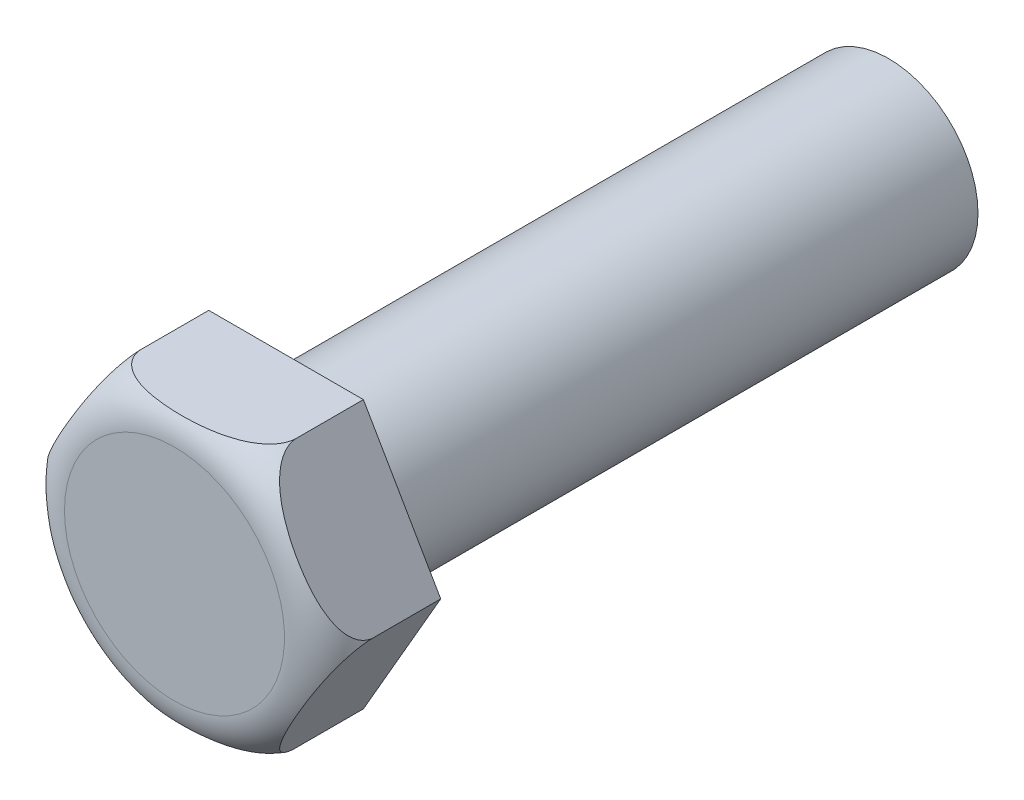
ISO-10303-21;
HEADER;
FILE_DESCRIPTION(('STEP AP214'),'2;1');
FILE_NAME('part.step','',(''),(''),'','','');
FILE_SCHEMA(('AUTOMOTIVE_DESIGN { 1 0 10303 214 1 1 1 1 }'));
ENDSEC;
DATA;
#1=APPLICATION_CONTEXT('core data for automotive mechanical design processes');
#2=APPLICATION_PROTOCOL_DEFINITION('international standard','automotive_design',2000,#1);
#3=PRODUCT_CONTEXT('',#1,'mechanical');
#4=PRODUCT('Part','Part','',(#3));
#5=PRODUCT_RELATED_PRODUCT_CATEGORY('part','',(#4));
#6=PRODUCT_DEFINITION_FORMATION('','',#4);
#7=PRODUCT_DEFINITION_CONTEXT('part definition',#1,'design');
#8=PRODUCT_DEFINITION('design','',#6,#7);
#9=PRODUCT_DEFINITION_SHAPE('','',#8);
#10=(LENGTH_UNIT() NAMED_UNIT(*) SI_UNIT(.MILLI.,.METRE.));
#11=(NAMED_UNIT(*) PLANE_ANGLE_UNIT() SI_UNIT($,.RADIAN.));
#12=(NAMED_UNIT(*) SI_UNIT($,.STERADIAN.) SOLID_ANGLE_UNIT());
#13=UNCERTAINTY_MEASURE_WITH_UNIT(LENGTH_MEASURE(1.E-05),#10,'distance_accuracy_value','');
#14=(GEOMETRIC_REPRESENTATION_CONTEXT(3) GLOBAL_UNCERTAINTY_ASSIGNED_CONTEXT((#13)) GLOBAL_UNIT_ASSIGNED_CONTEXT((#10,
#11,#12)) REPRESENTATION_CONTEXT('',''));
#15=CARTESIAN_POINT('',(0.,0.,0.));
#16=DIRECTION('',(0.,0.,1.));
#17=DIRECTION('',(1.,0.,0.));
#18=AXIS2_PLACEMENT_3D('',#15,#16,#17);
#19=CARTESIAN_POINT('',(35.,4.92661467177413E-13,-27.));
#20=DIRECTION('',(0.,0.,1.));
#21=DIRECTION('',(1.,0.,0.));
#22=AXIS2_PLACEMENT_3D('',#19,#20,#21);
#23=CYLINDRICAL_SURFACE('',#22,4.);
#24=CARTESIAN_POINT('',(35.,4.92661467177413E-13,-27.));
#25=DIRECTION('',(0.,0.,1.));
#26=DIRECTION('',(1.,0.,0.));
#27=AXIS2_PLACEMENT_3D('',#24,#25,#26);
#28=CIRCLE('',#27,4.);
#29=CARTESIAN_POINT('',(39.,4.92661467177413E-13,-27.));
#30=VERTEX_POINT('',#29);
#31=EDGE_CURVE('E11',#30,#30,#28,.T.);
#32=ORIENTED_EDGE('',*,*,#31,.T.);
#33=EDGE_LOOP('',(#32));
#34=FACE_BOUND('',#33,.T.);
#35=CARTESIAN_POINT('',(35.,4.92661467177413E-13,0.));
#36=DIRECTION('',(0.,0.,1.));
#37=DIRECTION('',(1.,0.,0.));
#38=AXIS2_PLACEMENT_3D('',#35,#36,#37);
#39=CIRCLE('',#38,4.);
#40=CARTESIAN_POINT('',(39.,4.92661467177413E-13,0.));
#41=VERTEX_POINT('',#40);
#42=EDGE_CURVE('E33',#41,#41,#39,.T.);
#43=ORIENTED_EDGE('',*,*,#42,.F.);
#44=EDGE_LOOP('',(#43));
#45=FACE_BOUND('',#44,.T.);
#46=ADVANCED_FACE('F26',(#34,#45),#23,.T.);
#47=CARTESIAN_POINT('',(35.,4.92661467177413E-13,-27.));
#48=DIRECTION('',(0.,0.,1.));
#49=DIRECTION('',(1.,0.,0.));
#50=AXIS2_PLACEMENT_3D('',#47,#48,#49);
#51=PLANE('',#50);
#52=ORIENTED_EDGE('',*,*,#31,.F.);
#53=EDGE_LOOP('',(#52));
#54=FACE_BOUND('',#53,.T.);
#55=ADVANCED_FACE('F115',(#54),#51,.F.);
#56=CARTESIAN_POINT('',(38.4641016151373,-5.99999999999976,5.));
#57=DIRECTION('',(-0.866025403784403,0.500000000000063,0.));
#58=DIRECTION('',(-0.500000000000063,-0.866025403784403,0.));
#59=AXIS2_PLACEMENT_3D('',#56,#57,#58);
#60=PLANE('',#59);
#61=DIRECTION('',(0.,0.,-1.));
#62=VECTOR('',#61,1.);
#63=CARTESIAN_POINT('',(41.9282032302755,0.,5.));
#64=LINE('',#63,#62);
#65=CARTESIAN_POINT('',(41.9282032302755,0.,2.99999999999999));
#66=VERTEX_POINT('',#65);
#67=CARTESIAN_POINT('',(41.9282032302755,0.,0.));
#68=VERTEX_POINT('',#67);
#69=EDGE_CURVE('E107',#66,#68,#64,.T.);
#70=ORIENTED_EDGE('',*,*,#69,.F.);
#71=CARTESIAN_POINT('',(41.9282032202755,-1.73205084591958E-08,2.99979999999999));
#72=CARTESIAN_POINT('',(41.9282085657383,9.24129264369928E-06,3.02934367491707));
#73=CARTESIAN_POINT('',(41.9275539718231,-0.00112454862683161,3.05887183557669));
#74=CARTESIAN_POINT('',(41.9249525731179,-0.00563030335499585,3.11768115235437));
#75=CARTESIAN_POINT('',(41.9230065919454,-0.00900084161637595,3.1469624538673));
#76=CARTESIAN_POINT('',(41.9153135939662,-0.0223255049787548,3.23369723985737));
#77=CARTESIAN_POINT('',(41.9077105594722,-0.0354943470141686,3.29052721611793));
#78=CARTESIAN_POINT('',(41.8880961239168,-0.0694675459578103,3.40083363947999));
#79=CARTESIAN_POINT('',(41.8760946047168,-0.0902547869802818,3.45431729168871));
#80=CARTESIAN_POINT('',(41.8483636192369,-0.138286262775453,3.55734093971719));
#81=CARTESIAN_POINT('',(41.8326270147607,-0.165542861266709,3.60687313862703));
#82=CARTESIAN_POINT('',(41.7888018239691,-0.24145031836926,3.72714474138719));
#83=CARTESIAN_POINT('',(41.7586370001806,-0.293697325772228,3.79485748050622));
#84=CARTESIAN_POINT('',(41.6933516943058,-0.406774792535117,3.91990090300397));
#85=CARTESIAN_POINT('',(41.6582195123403,-0.467625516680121,3.97720632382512));
#86=CARTESIAN_POINT('',(41.5621927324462,-0.633948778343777,4.1144349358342));
#87=CARTESIAN_POINT('',(41.4986434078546,-0.744019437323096,4.1868657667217));
#88=CARTESIAN_POINT('',(41.3670119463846,-0.972011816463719,4.31227447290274));
#89=CARTESIAN_POINT('',(41.2989206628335,-1.08994937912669,4.36521160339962));
#90=CARTESIAN_POINT('',(41.1597943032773,-1.33092330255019,4.45629465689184));
#91=CARTESIAN_POINT('',(41.0887406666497,-1.45399181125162,4.49432412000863));
#92=CARTESIAN_POINT('',(40.945266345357,-1.70249662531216,4.55844611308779));
#93=CARTESIAN_POINT('',(40.87284421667,-1.82793543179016,4.5845252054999));
#94=CARTESIAN_POINT('',(40.727003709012,-2.08053860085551,4.62725818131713));
#95=CARTESIAN_POINT('',(40.6535823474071,-2.20770812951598,4.64387005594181));
#96=CARTESIAN_POINT('',(40.5064449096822,-2.46255764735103,4.66913492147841));
#97=CARTESIAN_POINT('',(40.4327289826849,-2.59023737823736,4.67779152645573));
#98=CARTESIAN_POINT('',(40.2715323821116,-2.8694380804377,4.68901643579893));
#99=CARTESIAN_POINT('',(40.1840270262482,-3.02100180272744,4.6901629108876));
#100=CARTESIAN_POINT('',(40.0090620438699,-3.32405004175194,4.6827606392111));
#101=CARTESIAN_POINT('',(39.921602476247,-3.47553445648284,4.67420607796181));
#102=CARTESIAN_POINT('',(39.7475876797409,-3.77693692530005,4.64621390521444));
#103=CARTESIAN_POINT('',(39.6610301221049,-3.92685901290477,4.62683630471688));
#104=CARTESIAN_POINT('',(39.4889807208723,-4.22485731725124,4.57458020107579));
#105=CARTESIAN_POINT('',(39.4034876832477,-4.37293560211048,4.54171855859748));
#106=CARTESIAN_POINT('',(39.263133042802,-4.61603697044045,4.47222654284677));
#107=CARTESIAN_POINT('',(39.2076590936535,-4.71212066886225,4.44059934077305));
#108=CARTESIAN_POINT('',(39.098216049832,-4.90168158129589,4.36768698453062));
#109=CARTESIAN_POINT('',(39.0442485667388,-4.99515600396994,4.32639190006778));
#110=CARTESIAN_POINT('',(38.9384744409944,-5.17836216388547,4.23166332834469));
#111=CARTESIAN_POINT('',(38.8866884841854,-5.26805807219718,4.1781355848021));
#112=CARTESIAN_POINT('',(38.7875080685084,-5.43984359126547,4.05659769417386));
#113=CARTESIAN_POINT('',(38.7401050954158,-5.52194794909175,3.98861650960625));
#114=CARTESIAN_POINT('',(38.6683188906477,-5.64628530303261,3.86335065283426));
#115=CARTESIAN_POINT('',(38.6417880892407,-5.69223799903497,3.81101220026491));
#116=CARTESIAN_POINT('',(38.5928142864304,-5.77706311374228,3.69910751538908));
#117=CARTESIAN_POINT('',(38.5703674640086,-5.81594215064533,3.63954812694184));
#118=CARTESIAN_POINT('',(38.5338745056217,-5.87914980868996,3.52296156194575));
#119=CARTESIAN_POINT('',(38.5190743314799,-5.90478446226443,3.46688543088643));
#120=CARTESIAN_POINT('',(38.4943506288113,-5.94760717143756,3.35062109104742));
#121=CARTESIAN_POINT('',(38.4844167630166,-5.96481313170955,3.29044191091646));
#122=CARTESIAN_POINT('',(38.4729427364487,-5.98468672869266,3.19148118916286));
#123=CARTESIAN_POINT('',(38.4696403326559,-5.99040665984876,3.15349367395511));
#124=CARTESIAN_POINT('',(38.4652111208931,-5.9980782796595,3.07694805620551));
#125=CARTESIAN_POINT('',(38.4640882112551,-6.00002321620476,3.03838905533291));
#126=CARTESIAN_POINT('',(38.4641016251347,-5.99999998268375,2.99979999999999));
#127=B_SPLINE_CURVE_WITH_KNOTS('',3,(#71,#72,#73,#74,#75,#76,#77,#78,#79,#80,#81,#82,#83,#84,
#85,#86,#87,#88,#89,#90,#91,#92,#93,#94,#95,#96,#97,#98,#99,#100,#101,#102,#103,#104,#105,#106,
#107,#108,#109,#110,#111,#112,#113,#114,#115,#116,#117,#118,#119,#120,#121,#122,#123,#124,#125,
#126),.UNSPECIFIED.,.F.,.F.,(4,2,2,2,2,2,2,2,2,2,2,2,2,2,2,2,2,2,2,2,2,2,2,2,2,2,2,4),(0.,
0.0885718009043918,0.177087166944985,0.352681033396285,0.527882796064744,0.703422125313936,
0.973942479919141,1.24511096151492,1.68149626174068,2.11878856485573,2.55943201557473,
3.0005697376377,3.44364997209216,3.88652881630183,4.4113031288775,4.93639214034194,
5.45859816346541,5.98015319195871,6.32592314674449,6.67204982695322,7.02093924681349,
7.36913602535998,7.59210399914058,7.81486227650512,8.00434089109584,8.19341524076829,
8.30885546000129,8.4245019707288),.UNSPECIFIED.);
#128=CARTESIAN_POINT('',(38.4641016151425,-5.99999999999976,2.99999999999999));
#129=VERTEX_POINT('',#128);
#130=EDGE_CURVE('E134',#66,#129,#127,.T.);
#131=ORIENTED_EDGE('',*,*,#130,.T.);
#132=DIRECTION('',(0.,0.,-1.));
#133=VECTOR('',#132,1.);
#134=CARTESIAN_POINT('',(38.4641016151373,-5.99999999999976,5.));
#135=LINE('',#134,#133);
#136=CARTESIAN_POINT('',(38.4641016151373,-5.99999999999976,0.));
#137=VERTEX_POINT('',#136);
#138=EDGE_CURVE('E48',#129,#137,#135,.T.);
#139=ORIENTED_EDGE('',*,*,#138,.T.);
#140=DIRECTION('',(0.500000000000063,0.866025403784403,0.));
#141=VECTOR('',#140,1.);
#142=CARTESIAN_POINT('',(38.4641016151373,-5.99999999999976,0.));
#143=LINE('',#142,#141);
#144=EDGE_CURVE('E141',#137,#68,#143,.T.);
#145=ORIENTED_EDGE('',*,*,#144,.T.);
#146=EDGE_LOOP('',(#70,#131,#139,#145));
#147=FACE_BOUND('',#146,.T.);
#148=ADVANCED_FACE('F120',(#147),#60,.F.);
#149=CARTESIAN_POINT('',(41.9282032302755,0.,5.));
#150=DIRECTION('',(-0.866025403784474,-0.499999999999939,0.));
#151=DIRECTION('',(0.499999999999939,-0.866025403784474,0.));
#152=AXIS2_PLACEMENT_3D('',#149,#150,#151);
#153=PLANE('',#152);
#154=DIRECTION('',(0.,0.,-1.));
#155=VECTOR('',#154,1.);
#156=CARTESIAN_POINT('',(38.4641016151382,6.00000000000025,5.));
#157=LINE('',#156,#155);
#158=CARTESIAN_POINT('',(38.464101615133,6.00000000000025,2.99999999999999));
#159=VERTEX_POINT('',#158);
#160=CARTESIAN_POINT('',(38.4641016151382,6.00000000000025,0.));
#161=VERTEX_POINT('',#160);
#162=EDGE_CURVE('E101',#159,#161,#157,.T.);
#163=ORIENTED_EDGE('',*,*,#162,.F.);
#164=CARTESIAN_POINT('',(38.4641016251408,5.99999998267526,2.99979999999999));
#165=CARTESIAN_POINT('',(38.464096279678,6.00000924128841,3.02934367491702));
#166=CARTESIAN_POINT('',(38.4647508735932,5.99887545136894,3.0588718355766));
#167=CARTESIAN_POINT('',(38.4673522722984,5.99436969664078,3.11768115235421));
#168=CARTESIAN_POINT('',(38.4692982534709,5.99099915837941,3.1469624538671));
#169=CARTESIAN_POINT('',(38.47699125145,5.97767449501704,3.23369723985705));
#170=CARTESIAN_POINT('',(38.4845942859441,5.96450565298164,3.29052721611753));
#171=CARTESIAN_POINT('',(38.5042087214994,5.93053245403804,3.40083363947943));
#172=CARTESIAN_POINT('',(38.5162102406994,5.9097452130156,3.45431729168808));
#173=CARTESIAN_POINT('',(38.5439412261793,5.86171373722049,3.55734093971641));
#174=CARTESIAN_POINT('',(38.5596778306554,5.83445713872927,3.60687313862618));
#175=CARTESIAN_POINT('',(38.603503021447,5.7585496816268,3.7271447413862));
#176=CARTESIAN_POINT('',(38.6336678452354,5.70630267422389,3.79485748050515));
#177=CARTESIAN_POINT('',(38.6989531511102,5.59322520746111,3.91990090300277));
#178=CARTESIAN_POINT('',(38.7340853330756,5.53237448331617,3.97720632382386));
#179=CARTESIAN_POINT('',(38.8301121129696,5.36605122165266,4.11443493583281));
#180=CARTESIAN_POINT('',(38.8936614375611,5.25598056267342,4.18686576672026));
#181=CARTESIAN_POINT('',(39.025292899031,5.02798818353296,4.31227447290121));
#182=CARTESIAN_POINT('',(39.0933841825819,4.91005062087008,4.36521160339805));
#183=CARTESIAN_POINT('',(39.2325105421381,4.66907669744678,4.45629465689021));
#184=CARTESIAN_POINT('',(39.3035641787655,4.54600818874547,4.49432412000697));
#185=CARTESIAN_POINT('',(39.4470385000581,4.29750337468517,4.55844611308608));
#186=CARTESIAN_POINT('',(39.5194606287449,4.17206456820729,4.58452520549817));
#187=CARTESIAN_POINT('',(39.6653011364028,3.91946139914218,4.62725818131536));
#188=CARTESIAN_POINT('',(39.7387224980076,3.79229187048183,4.64387005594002));
#189=CARTESIAN_POINT('',(39.8858599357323,3.53744235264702,4.66913492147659));
#190=CARTESIAN_POINT('',(39.9595758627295,3.40976262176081,4.6777915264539));
#191=CARTESIAN_POINT('',(40.1207724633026,3.1305619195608,4.68901643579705));
#192=CARTESIAN_POINT('',(40.2082778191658,2.97899819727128,4.6901629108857));
#193=CARTESIAN_POINT('',(40.3832428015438,2.67594995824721,4.68276063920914));
#194=CARTESIAN_POINT('',(40.4707023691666,2.52446554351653,4.67420607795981));
#195=CARTESIAN_POINT('',(40.6447171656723,2.22306307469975,4.64621390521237));
#196=CARTESIAN_POINT('',(40.7312747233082,2.07314098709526,4.62683630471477));
#197=CARTESIAN_POINT('',(40.9033241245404,1.77514268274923,4.57458020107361));
#198=CARTESIAN_POINT('',(40.9888171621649,1.62706439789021,4.54171855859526));
#199=CARTESIAN_POINT('',(41.1291718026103,1.38396302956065,4.47222654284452));
#200=CARTESIAN_POINT('',(41.1846457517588,1.28787933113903,4.44059934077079));
#201=CARTESIAN_POINT('',(41.2940887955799,1.09831841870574,4.36768698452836));
#202=CARTESIAN_POINT('',(41.348056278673,1.00484399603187,4.32639190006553));
#203=CARTESIAN_POINT('',(41.4538304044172,0.821637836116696,4.23166332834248));
#204=CARTESIAN_POINT('',(41.5056163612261,0.731941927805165,4.17813558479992));
#205=CARTESIAN_POINT('',(41.6047967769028,0.56015640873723,4.05659769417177));
#206=CARTESIAN_POINT('',(41.6521997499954,0.478052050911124,3.98861650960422));
#207=CARTESIAN_POINT('',(41.7239859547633,0.353714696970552,3.86335065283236));
#208=CARTESIAN_POINT('',(41.7505167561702,0.307762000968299,3.81101220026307));
#209=CARTESIAN_POINT('',(41.7994905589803,0.222936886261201,3.69910751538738));
#210=CARTESIAN_POINT('',(41.8219373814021,0.184057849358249,3.63954812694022));
#211=CARTESIAN_POINT('',(41.8584303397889,0.120850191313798,3.52296156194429));
#212=CARTESIAN_POINT('',(41.8732305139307,0.0952155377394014,3.46688543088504));
#213=CARTESIAN_POINT('',(41.8979542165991,0.0523928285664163,3.35062109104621));
#214=CARTESIAN_POINT('',(41.9078880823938,0.0351868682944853,3.29044191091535));
#215=CARTESIAN_POINT('',(41.9193621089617,0.0153132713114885,3.19148118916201));
#216=CARTESIAN_POINT('',(41.9226645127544,0.00959334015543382,3.15349367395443));
#217=CARTESIAN_POINT('',(41.9270937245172,0.00192172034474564,3.07694805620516));
#218=CARTESIAN_POINT('',(41.9282166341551,-2.3216200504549E-05,3.03838905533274));
#219=CARTESIAN_POINT('',(41.9282032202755,1.73205091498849E-08,2.99979999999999));
#220=B_SPLINE_CURVE_WITH_KNOTS('',3,(#164,#165,#166,#167,#168,#169,#170,#171,#172,#173,#174,
#175,#176,#177,#178,#179,#180,#181,#182,#183,#184,#185,#186,#187,#188,#189,#190,#191,#192,#193,
#194,#195,#196,#197,#198,#199,#200,#201,#202,#203,#204,#205,#206,#207,#208,#209,#210,#211,#212,
#213,#214,#215,#216,#217,#218,#219),.UNSPECIFIED.,.F.,.F.,(4,2,2,2,2,2,2,2,2,2,2,2,2,2,2,2,2,2,
2,2,2,2,2,2,2,2,2,4),(0.,0.0885718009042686,0.177087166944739,0.352681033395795,
0.527882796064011,0.703422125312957,0.973942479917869,1.24511096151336,1.68149626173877,
2.11878856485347,2.55943201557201,3.00056973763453,3.44364997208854,3.88652881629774,
4.41130312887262,4.93639214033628,5.45859816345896,5.98015319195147,6.32592314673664,
6.67204982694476,7.02093924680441,7.36913602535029,7.59210399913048,7.81486227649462,
8.004340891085,8.19341524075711,8.3088554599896,8.42450197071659),.UNSPECIFIED.);
#221=EDGE_CURVE('E142',#159,#66,#220,.T.);
#222=ORIENTED_EDGE('',*,*,#221,.T.);
#223=ORIENTED_EDGE('',*,*,#69,.T.);
#224=DIRECTION('',(-0.499999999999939,0.866025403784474,0.));
#225=VECTOR('',#224,1.);
#226=CARTESIAN_POINT('',(41.9282032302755,0.,0.));
#227=LINE('',#226,#225);
#228=EDGE_CURVE('E200',#68,#161,#227,.T.);
#229=ORIENTED_EDGE('',*,*,#228,.T.);
#230=EDGE_LOOP('',(#163,#222,#223,#229));
#231=FACE_BOUND('',#230,.T.);
#232=ADVANCED_FACE('F127',(#231),#153,.F.);
#233=CARTESIAN_POINT('',(38.4641016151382,6.00000000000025,5.));
#234=DIRECTION('',(0.,-1.,0.));
#235=DIRECTION('',(1.,0.,0.));
#236=AXIS2_PLACEMENT_3D('',#233,#234,#235);
#237=PLANE('',#236);
#238=DIRECTION('',(0.,0.,-1.));
#239=VECTOR('',#238,1.);
#240=CARTESIAN_POINT('',(31.5358983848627,6.00000000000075,5.));
#241=LINE('',#240,#239);
#242=CARTESIAN_POINT('',(31.5358983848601,5.99999999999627,2.99999999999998));
#243=VERTEX_POINT('',#242);
#244=CARTESIAN_POINT('',(31.5358983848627,6.00000000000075,0.));
#245=VERTEX_POINT('',#244);
#246=EDGE_CURVE('E99',#243,#245,#241,.T.);
#247=ORIENTED_EDGE('',*,*,#246,.F.);
#248=CARTESIAN_POINT('',(35.0000000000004,6.00000000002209,4.68856497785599));
#249=CARTESIAN_POINT('',(35.1686041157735,6.00000000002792,4.688571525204));
#250=CARTESIAN_POINT('',(35.3372225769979,6.00000000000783,4.68410578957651));
#251=CARTESIAN_POINT('',(35.6740745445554,5.99999999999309,4.66564477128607));
#252=CARTESIAN_POINT('',(35.8423076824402,5.99999999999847,4.65164257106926));
#253=CARTESIAN_POINT('',(36.1774330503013,6.00000000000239,4.61223562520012));
#254=CARTESIAN_POINT('',(36.3443257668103,6.00000000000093,4.58683522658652));
#255=CARTESIAN_POINT('',(36.6750871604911,5.99999999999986,4.52146393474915));
#256=CARTESIAN_POINT('',(36.838959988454,6.00000000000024,4.48151489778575));
#257=CARTESIAN_POINT('',(37.1450411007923,6.00000000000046,4.38712344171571));
#258=CARTESIAN_POINT('',(37.2877842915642,6.00000000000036,4.33451519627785));
#259=CARTESIAN_POINT('',(37.4947218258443,6.00000000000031,4.24033987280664));
#260=CARTESIAN_POINT('',(37.562413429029,6.00000000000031,4.20646335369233));
#261=CARTESIAN_POINT('',(37.6945521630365,6.00000000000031,4.13292545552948));
#262=CARTESIAN_POINT('',(37.759001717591,6.0000000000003,4.0932684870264));
#263=CARTESIAN_POINT('',(37.8897716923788,6.00000000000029,4.00310383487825));
#264=CARTESIAN_POINT('',(37.9556229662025,6.00000000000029,3.95190460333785));
#265=CARTESIAN_POINT('',(38.0796090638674,6.00000000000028,3.84077297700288));
#266=CARTESIAN_POINT('',(38.13774828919,6.00000000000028,3.78084560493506));
#267=CARTESIAN_POINT('',(38.2338895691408,6.00000000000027,3.66319433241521));
#268=CARTESIAN_POINT('',(38.2736352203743,6.00000000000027,3.60690892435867));
#269=CARTESIAN_POINT('',(38.3433963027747,6.00000000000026,3.48858075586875));
#270=CARTESIAN_POINT('',(38.3734249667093,6.00000000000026,3.42654597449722));
#271=CARTESIAN_POINT('',(38.4177642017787,6.00000000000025,3.30792868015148));
#272=CARTESIAN_POINT('',(38.4337891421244,6.00000000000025,3.251990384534));
#273=CARTESIAN_POINT('',(38.456180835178,6.00000000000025,3.13820466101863));
#274=CARTESIAN_POINT('',(38.4625523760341,6.00000000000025,3.08035819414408));
#275=CARTESIAN_POINT('',(38.4651510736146,6.00000000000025,2.96435213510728));
#276=CARTESIAN_POINT('',(38.461363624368,6.00000000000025,2.90619221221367));
#277=CARTESIAN_POINT('',(38.4439126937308,6.00000000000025,2.79137983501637));
#278=CARTESIAN_POINT('',(38.4302461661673,6.00000000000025,2.73472785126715));
#279=CARTESIAN_POINT('',(38.3942281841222,6.00000000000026,2.62502382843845));
#280=CARTESIAN_POINT('',(38.3719787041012,6.00000000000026,2.57193780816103));
#281=CARTESIAN_POINT('',(38.3200958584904,6.00000000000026,2.46954366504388));
#282=CARTESIAN_POINT('',(38.2904596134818,6.00000000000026,2.42023702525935));
#283=CARTESIAN_POINT('',(38.207910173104,6.00000000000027,2.30092526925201));
#284=CARTESIAN_POINT('',(38.1509618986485,6.00000000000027,2.23370998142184));
#285=CARTESIAN_POINT('',(38.0271365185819,6.00000000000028,2.10915146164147));
#286=CARTESIAN_POINT('',(37.9602342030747,6.00000000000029,2.05183411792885));
#287=CARTESIAN_POINT('',(37.778394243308,6.0000000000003,1.91531676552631));
#288=CARTESIAN_POINT('',(37.6583128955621,6.00000000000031,1.84302226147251));
#289=CARTESIAN_POINT('',(37.4089565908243,6.00000000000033,1.71698911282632));
#290=CARTESIAN_POINT('',(37.2796632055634,6.00000000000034,1.66328899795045));
#291=CARTESIAN_POINT('',(37.0176171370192,6.00000000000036,1.57105246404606));
#292=CARTESIAN_POINT('',(36.8849232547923,6.00000000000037,1.53234463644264));
#293=CARTESIAN_POINT('',(36.6167047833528,6.00000000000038,1.46615535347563));
#294=CARTESIAN_POINT('',(36.4811773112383,6.00000000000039,1.43868598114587));
#295=CARTESIAN_POINT('',(36.2081299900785,6.00000000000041,1.39267161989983));
#296=CARTESIAN_POINT('',(36.0706045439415,6.00000000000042,1.37416078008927));
#297=CARTESIAN_POINT('',(35.7948380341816,6.00000000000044,1.34463146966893));
#298=CARTESIAN_POINT('',(35.6565972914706,6.00000000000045,1.3336098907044));
#299=CARTESIAN_POINT('',(35.3314518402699,6.00000000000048,1.31531229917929));
#300=CARTESIAN_POINT('',(35.1443968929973,6.00000000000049,1.31068488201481));
#301=CARTESIAN_POINT('',(34.7702206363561,6.00000000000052,1.31237798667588));
#302=CARTESIAN_POINT('',(34.5830993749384,6.00000000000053,1.31870632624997));
#303=CARTESIAN_POINT('',(34.2098449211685,6.00000000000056,1.34337069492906));
#304=CARTESIAN_POINT('',(34.0237106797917,6.00000000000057,1.36168903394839));
#305=CARTESIAN_POINT('',(33.7461744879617,6.00000000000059,1.40040651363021));
#306=CARTESIAN_POINT('',(33.6539806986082,6.0000000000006,1.41517657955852));
#307=CARTESIAN_POINT('',(33.4704012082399,6.00000000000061,1.44905313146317));
#308=CARTESIAN_POINT('',(33.3790153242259,6.00000000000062,1.46815860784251));
#309=CARTESIAN_POINT('',(33.1966956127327,6.00000000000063,1.51158690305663));
#310=CARTESIAN_POINT('',(33.1057713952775,6.00000000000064,1.53595060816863));
#311=CARTESIAN_POINT('',(32.9257722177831,6.00000000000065,1.59068534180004));
#312=CARTESIAN_POINT('',(32.8366963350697,6.00000000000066,1.62105328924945));
#313=CARTESIAN_POINT('',(32.6617030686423,6.00000000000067,1.68869663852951));
#314=CARTESIAN_POINT('',(32.5757716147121,6.00000000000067,1.72593512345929));
#315=CARTESIAN_POINT('',(32.4079982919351,6.00000000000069,1.80860760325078));
#316=CARTESIAN_POINT('',(32.3261514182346,6.00000000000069,1.85403123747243));
#317=CARTESIAN_POINT('',(32.1791585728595,6.0000000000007,1.94762265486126));
#318=CARTESIAN_POINT('',(32.1132527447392,6.00000000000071,1.99458355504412));
#319=CARTESIAN_POINT('',(31.9877465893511,6.00000000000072,2.09654168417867));
#320=CARTESIAN_POINT('',(31.9281529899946,6.00000000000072,2.15154734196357));
#321=CARTESIAN_POINT('',(31.8173401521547,6.00000000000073,2.27080506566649));
#322=CARTESIAN_POINT('',(31.7662283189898,6.00000000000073,2.33515881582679));
#323=CARTESIAN_POINT('',(31.6769491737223,6.00000000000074,2.47229349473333));
#324=CARTESIAN_POINT('',(31.6387468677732,6.00000000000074,2.54505091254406));
#325=CARTESIAN_POINT('',(31.5876963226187,6.00000000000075,2.67520114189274));
#326=CARTESIAN_POINT('',(31.5707138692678,6.00000000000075,2.73097704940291));
#327=CARTESIAN_POINT('',(31.5463555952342,6.00000000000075,2.84459813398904));
#328=CARTESIAN_POINT('',(31.5389737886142,6.00000000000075,2.90244199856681));
#329=CARTESIAN_POINT('',(31.5343801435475,6.00000000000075,3.01864328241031));
#330=CARTESIAN_POINT('',(31.5371871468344,6.00000000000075,3.07700145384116));
#331=CARTESIAN_POINT('',(31.5527873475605,6.00000000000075,3.19236236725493));
#332=CARTESIAN_POINT('',(31.5655833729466,6.00000000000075,3.24936472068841));
#333=CARTESIAN_POINT('',(31.5999274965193,6.00000000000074,3.35954912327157));
#334=CARTESIAN_POINT('',(31.6213213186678,6.00000000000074,3.41278000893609));
#335=CARTESIAN_POINT('',(31.6715771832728,6.00000000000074,3.51555710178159));
#336=CARTESIAN_POINT('',(31.7004424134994,6.00000000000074,3.56510172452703));
#337=CARTESIAN_POINT('',(31.7805968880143,6.00000000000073,3.68424362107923));
#338=CARTESIAN_POINT('',(31.8358181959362,6.00000000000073,3.75119711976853));
#339=CARTESIAN_POINT('',(31.9561791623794,6.00000000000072,3.87547509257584));
#340=CARTESIAN_POINT('',(32.021341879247,6.00000000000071,3.93277651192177));
#341=CARTESIAN_POINT('',(32.1979345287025,6.0000000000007,4.0688589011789));
#342=CARTESIAN_POINT('',(32.3144161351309,6.00000000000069,4.14103363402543));
#343=CARTESIAN_POINT('',(32.5567176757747,6.00000000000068,4.2673440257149));
#344=CARTESIAN_POINT('',(32.6825625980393,6.00000000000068,4.32142913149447));
#345=CARTESIAN_POINT('',(32.9366979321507,6.00000000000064,4.41426863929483));
#346=CARTESIAN_POINT('',(33.0648832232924,6.0000000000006,4.45331819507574));
#347=CARTESIAN_POINT('',(33.3241401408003,6.00000000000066,4.52052337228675));
#348=CARTESIAN_POINT('',(33.455214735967,6.00000000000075,4.54866717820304));
#349=CARTESIAN_POINT('',(33.7189688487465,6.00000000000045,4.59618443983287));
#350=CARTESIAN_POINT('',(33.8516491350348,6.00000000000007,4.6155535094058));
#351=CARTESIAN_POINT('',(34.1177796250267,6.00000000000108,4.6470470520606));
#352=CARTESIAN_POINT('',(34.2512294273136,6.00000000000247,4.65917500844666));
#353=CARTESIAN_POINT('',(34.4872470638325,5.99999999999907,4.67509046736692));
#354=CARTESIAN_POINT('',(34.5897319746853,5.99999999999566,4.68016573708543));
#355=CARTESIAN_POINT('',(34.7948094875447,6.00000000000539,4.6869009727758));
#356=CARTESIAN_POINT('',(34.8974020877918,6.00000000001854,4.68856099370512));
#357=CARTESIAN_POINT('',(35.0000000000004,6.00000000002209,4.68856497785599));
#358=B_SPLINE_CURVE_WITH_KNOTS('',3,(#248,#249,#250,#251,#252,#253,#254,#255,#256,#257,#258,
#259,#260,#261,#262,#263,#264,#265,#266,#267,#268,#269,#270,#271,#272,#273,#274,#275,#276,#277,
#278,#279,#280,#281,#282,#283,#284,#285,#286,#287,#288,#289,#290,#291,#292,#293,#294,#295,#296,
#297,#298,#299,#300,#301,#302,#303,#304,#305,#306,#307,#308,#309,#310,#311,#312,#313,#314,#315,
#316,#317,#318,#319,#320,#321,#322,#323,#324,#325,#326,#327,#328,#329,#330,#331,#332,#333,#334,
#335,#336,#337,#338,#339,#340,#341,#342,#343,#344,#345,#346,#347,#348,#349,#350,#351,#352,#353,
#354,#355,#356,#357),.UNSPECIFIED.,.T.,.F.,(4,2,2,2,2,2,2,2,2,2,2,2,2,2,2,2,2,2,2,2,2,2,2,2,2,2,
2,2,2,2,2,2,2,2,2,2,2,2,2,2,2,2,2,2,2,2,2,2,2,2,2,2,2,2,4),(0.,0.505772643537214,
1.01191255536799,1.51785959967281,2.02304967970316,2.47805042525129,2.70490524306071,
2.93158786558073,3.18117872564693,3.430626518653,3.63656974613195,3.84223132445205,
4.01603128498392,4.18974501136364,4.36370862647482,4.53772590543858,4.70973637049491,
4.88181399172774,5.14459875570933,5.40806075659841,5.82617987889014,6.24516027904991,
6.65919809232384,7.07367989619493,7.48972945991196,7.90560624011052,8.46658596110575,
9.02796614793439,9.588519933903,9.86854716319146,10.1485092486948,10.4307321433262,
10.7128105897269,10.9934153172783,11.2736673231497,11.5159254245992,11.7584391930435,
12.0038218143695,12.2485338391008,12.4227032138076,12.5967639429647,12.7711467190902,
12.9455788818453,13.1170116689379,13.2885177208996,13.5474021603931,13.8068964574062,
14.2156682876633,14.6255731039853,15.0269620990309,15.4287847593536,15.8308080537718,
16.2326378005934,16.5404123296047,16.8481819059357),.UNSPECIFIED.);
#359=EDGE_CURVE('E81',#243,#159,#358,.T.);
#360=ORIENTED_EDGE('',*,*,#359,.T.);
#361=ORIENTED_EDGE('',*,*,#162,.T.);
#362=DIRECTION('',(-1.,0.,0.));
#363=VECTOR('',#362,1.);
#364=CARTESIAN_POINT('',(38.4641016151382,6.00000000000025,0.));
#365=LINE('',#364,#363);
#366=EDGE_CURVE('E204',#161,#245,#365,.T.);
#367=ORIENTED_EDGE('',*,*,#366,.T.);
#368=EDGE_LOOP('',(#247,#360,#361,#367));
#369=FACE_BOUND('',#368,.T.);
#370=ADVANCED_FACE('F174',(#369),#237,.F.);
#371=CARTESIAN_POINT('',(31.5358983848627,6.00000000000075,5.));
#372=DIRECTION('',(0.866025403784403,-0.500000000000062,0.));
#373=DIRECTION('',(0.500000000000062,0.866025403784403,0.));
#374=AXIS2_PLACEMENT_3D('',#371,#372,#373);
#375=PLANE('',#374);
#376=DIRECTION('',(0.,0.,-1.));
#377=VECTOR('',#376,1.);
#378=CARTESIAN_POINT('',(28.0717967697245,9.89685536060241E-13,5.));
#379=LINE('',#378,#377);
#380=CARTESIAN_POINT('',(28.0717967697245,1.01177746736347E-12,2.99999999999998));
#381=VERTEX_POINT('',#380);
#382=CARTESIAN_POINT('',(28.0717967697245,9.89685536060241E-13,0.));
#383=VERTEX_POINT('',#382);
#384=EDGE_CURVE('E90',#381,#383,#379,.T.);
#385=ORIENTED_EDGE('',*,*,#384,.F.);
#386=CARTESIAN_POINT('',(28.0717967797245,1.73214747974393E-08,2.99979999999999));
#387=CARTESIAN_POINT('',(28.0717914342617,-9.24129167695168E-06,3.02934367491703));
#388=CARTESIAN_POINT('',(28.0724460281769,0.00112454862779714,3.0588718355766));
#389=CARTESIAN_POINT('',(28.0750474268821,0.00563030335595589,3.11768115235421));
#390=CARTESIAN_POINT('',(28.0769934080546,0.00900084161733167,3.1469624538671));
#391=CARTESIAN_POINT('',(28.0846864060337,0.0223255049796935,3.23369723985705));
#392=CARTESIAN_POINT('',(28.0922894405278,0.0354943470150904,3.29052721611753));
#393=CARTESIAN_POINT('',(28.1119038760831,0.0694675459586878,3.40083363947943));
#394=CARTESIAN_POINT('',(28.1239053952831,0.090254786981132,3.45431729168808));
#395=CARTESIAN_POINT('',(28.151636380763,0.138286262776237,3.55734093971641));
#396=CARTESIAN_POINT('',(28.1673729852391,0.165542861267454,3.60687313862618));
#397=CARTESIAN_POINT('',(28.2111981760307,0.241450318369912,3.72714474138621));
#398=CARTESIAN_POINT('',(28.2413629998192,0.293697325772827,3.79485748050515));
#399=CARTESIAN_POINT('',(28.3066483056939,0.406774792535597,3.91990090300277));
#400=CARTESIAN_POINT('',(28.3417804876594,0.467625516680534,3.97720632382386));
#401=CARTESIAN_POINT('',(28.4378072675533,0.633948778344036,4.11443493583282));
#402=CARTESIAN_POINT('',(28.5013565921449,0.744019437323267,4.18686576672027));
#403=CARTESIAN_POINT('',(28.6329880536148,0.972011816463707,4.31227447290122));
#404=CARTESIAN_POINT('',(28.7010793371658,1.08994937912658,4.36521160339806));
#405=CARTESIAN_POINT('',(28.840205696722,1.33092330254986,4.45629465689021));
#406=CARTESIAN_POINT('',(28.9112593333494,1.45399181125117,4.49432412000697));
#407=CARTESIAN_POINT('',(29.0547336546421,1.70249662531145,4.55844611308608));
#408=CARTESIAN_POINT('',(29.1271557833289,1.82793543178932,4.58452520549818));
#409=CARTESIAN_POINT('',(29.2729962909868,2.08053860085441,4.62725818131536));
#410=CARTESIAN_POINT('',(29.3464176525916,2.20770812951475,4.64387005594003));
#411=CARTESIAN_POINT('',(29.4935550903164,2.46255764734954,4.6691349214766));
#412=CARTESIAN_POINT('',(29.5672710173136,2.59023737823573,4.6777915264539));
#413=CARTESIAN_POINT('',(29.7284676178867,2.86943808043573,4.68901643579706));
#414=CARTESIAN_POINT('',(29.81597297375,3.02100180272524,4.6901629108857));
#415=CARTESIAN_POINT('',(29.990937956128,3.32405004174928,4.68276063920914));
#416=CARTESIAN_POINT('',(30.0783975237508,3.47553445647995,4.67420607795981));
#417=CARTESIAN_POINT('',(30.2524123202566,3.77693692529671,4.64621390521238));
#418=CARTESIAN_POINT('',(30.3389698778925,3.9268590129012,4.62683630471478));
#419=CARTESIAN_POINT('',(30.5110192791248,4.2248573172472,4.57458020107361));
#420=CARTESIAN_POINT('',(30.5965123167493,4.37293560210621,4.54171855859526));
#421=CARTESIAN_POINT('',(30.7368669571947,4.61603697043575,4.47222654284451));
#422=CARTESIAN_POINT('',(30.7923409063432,4.71212066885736,4.44059934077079));
#423=CARTESIAN_POINT('',(30.9017839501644,4.90168158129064,4.36768698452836));
#424=CARTESIAN_POINT('',(30.9557514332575,4.9951560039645,4.32639190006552));
#425=CARTESIAN_POINT('',(31.0615255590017,5.17836216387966,4.23166332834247));
#426=CARTESIAN_POINT('',(31.1133115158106,5.26805807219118,4.17813558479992));
#427=CARTESIAN_POINT('',(31.2124919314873,5.4398435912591,4.05659769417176));
#428=CARTESIAN_POINT('',(31.2598949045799,5.5219479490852,3.98861650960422));
#429=CARTESIAN_POINT('',(31.3316811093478,5.64628530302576,3.86335065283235));
#430=CARTESIAN_POINT('',(31.3582119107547,5.69223799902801,3.81101220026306));
#431=CARTESIAN_POINT('',(31.4071857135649,5.7770631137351,3.69910751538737));
#432=CARTESIAN_POINT('',(31.4296325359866,5.81594215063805,3.63954812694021));
#433=CARTESIAN_POINT('',(31.4661254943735,5.87914980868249,3.52296156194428));
#434=CARTESIAN_POINT('',(31.4809256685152,5.90478446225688,3.46688543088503));
#435=CARTESIAN_POINT('',(31.5056493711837,5.94760717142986,3.3506210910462));
#436=CARTESIAN_POINT('',(31.5155832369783,5.96481313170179,3.29044191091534));
#437=CARTESIAN_POINT('',(31.5270572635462,5.98468672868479,3.191481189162));
#438=CARTESIAN_POINT('',(31.5303596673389,5.99040665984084,3.15349367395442));
#439=CARTESIAN_POINT('',(31.5347888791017,5.99807827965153,3.07694805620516));
#440=CARTESIAN_POINT('',(31.5359117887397,6.00002321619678,3.03838905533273));
#441=CARTESIAN_POINT('',(31.5358983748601,5.99999998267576,2.99979999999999));
#442=B_SPLINE_CURVE_WITH_KNOTS('',3,(#386,#387,#388,#389,#390,#391,#392,#393,#394,#395,#396,
#397,#398,#399,#400,#401,#402,#403,#404,#405,#406,#407,#408,#409,#410,#411,#412,#413,#414,#415,
#416,#417,#418,#419,#420,#421,#422,#423,#424,#425,#426,#427,#428,#429,#430,#431,#432,#433,#434,
#435,#436,#437,#438,#439,#440,#441),.UNSPECIFIED.,.F.,.F.,(4,2,2,2,2,2,2,2,2,2,2,2,2,2,2,2,2,2,
2,2,2,2,2,2,2,2,2,4),(0.,0.0885718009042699,0.17708716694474,0.352681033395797,
0.527882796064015,0.703422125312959,0.973942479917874,1.24511096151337,1.68149626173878,
2.11878856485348,2.55943201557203,3.00056973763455,3.44364997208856,3.88652881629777,
4.41130312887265,4.93639214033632,5.45859816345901,5.98015319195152,6.3259231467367,
6.67204982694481,7.02093924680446,7.36913602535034,7.59210399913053,7.81486227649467,
8.00434089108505,8.19341524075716,8.30885545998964,8.42450197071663),.UNSPECIFIED.);
#443=EDGE_CURVE('E78',#381,#243,#442,.T.);
#444=ORIENTED_EDGE('',*,*,#443,.T.);
#445=ORIENTED_EDGE('',*,*,#246,.T.);
#446=DIRECTION('',(-0.500000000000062,-0.866025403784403,0.));
#447=VECTOR('',#446,1.);
#448=CARTESIAN_POINT('',(31.5358983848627,6.00000000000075,0.));
#449=LINE('',#448,#447);
#450=EDGE_CURVE('E97',#245,#383,#449,.T.);
#451=ORIENTED_EDGE('',*,*,#450,.T.);
#452=EDGE_LOOP('',(#385,#444,#445,#451));
#453=FACE_BOUND('',#452,.T.);
#454=ADVANCED_FACE('F95',(#453),#375,.F.);
#455=CARTESIAN_POINT('',(28.0717967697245,9.89685536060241E-13,5.));
#456=DIRECTION('',(0.866025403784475,0.499999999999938,0.));
#457=DIRECTION('',(-0.499999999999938,0.866025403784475,0.));
#458=AXIS2_PLACEMENT_3D('',#455,#456,#457);
#459=PLANE('',#458);
#460=DIRECTION('',(0.,0.,-1.));
#461=VECTOR('',#460,1.);
#462=CARTESIAN_POINT('',(31.5358983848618,-5.99999999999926,5.));
#463=LINE('',#462,#461);
#464=CARTESIAN_POINT('',(31.5358983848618,-5.99999999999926,2.99999999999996));
#465=VERTEX_POINT('',#464);
#466=CARTESIAN_POINT('',(31.5358983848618,-5.99999999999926,0.));
#467=VERTEX_POINT('',#466);
#468=EDGE_CURVE('E92',#465,#467,#463,.T.);
#469=ORIENTED_EDGE('',*,*,#468,.F.);
#470=CARTESIAN_POINT('',(31.5358983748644,-5.99999998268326,2.99979999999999));
#471=CARTESIAN_POINT('',(31.5359037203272,-6.00000924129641,3.02934367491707));
#472=CARTESIAN_POINT('',(31.535249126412,-5.99887545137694,3.05887183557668));
#473=CARTESIAN_POINT('',(31.5326477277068,-5.99436969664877,3.11768115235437));
#474=CARTESIAN_POINT('',(31.5307017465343,-5.99099915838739,3.1469624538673));
#475=CARTESIAN_POINT('',(31.5230087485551,-5.97767449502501,3.23369723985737));
#476=CARTESIAN_POINT('',(31.5154057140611,-5.9645056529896,3.29052721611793));
#477=CARTESIAN_POINT('',(31.4957912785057,-5.93053245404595,3.40083363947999));
#478=CARTESIAN_POINT('',(31.4837897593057,-5.90974521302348,3.45431729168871));
#479=CARTESIAN_POINT('',(31.4560587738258,-5.8617137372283,3.55734093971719));
#480=CARTESIAN_POINT('',(31.4403221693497,-5.83445713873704,3.60687313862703));
#481=CARTESIAN_POINT('',(31.396496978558,-5.75854968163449,3.7271447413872));
#482=CARTESIAN_POINT('',(31.3663321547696,-5.70630267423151,3.79485748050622));
#483=CARTESIAN_POINT('',(31.3010468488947,-5.59322520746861,3.91990090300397));
#484=CARTESIAN_POINT('',(31.2659146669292,-5.53237448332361,3.97720632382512));
#485=CARTESIAN_POINT('',(31.1698878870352,-5.36605122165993,4.1144349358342));
#486=CARTESIAN_POINT('',(31.1063385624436,-5.2559805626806,4.1868657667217));
#487=CARTESIAN_POINT('',(30.9747071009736,-5.02798818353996,4.31227447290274));
#488=CARTESIAN_POINT('',(30.9066158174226,-4.91005062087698,4.36521160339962));
#489=CARTESIAN_POINT('',(30.7674894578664,-4.66907669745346,4.45629465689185));
#490=CARTESIAN_POINT('',(30.6964358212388,-4.54600818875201,4.49432412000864));
#491=CARTESIAN_POINT('',(30.5529614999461,-4.29750337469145,4.5584461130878));
#492=CARTESIAN_POINT('',(30.4805393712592,-4.17206456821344,4.58452520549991));
#493=CARTESIAN_POINT('',(30.3346988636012,-3.91946139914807,4.62725818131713));
#494=CARTESIAN_POINT('',(30.2612775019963,-3.79229187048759,4.64387005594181));
#495=CARTESIAN_POINT('',(30.1141400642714,-3.53744235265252,4.66913492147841));
#496=CARTESIAN_POINT('',(30.0404241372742,-3.40976262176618,4.67779152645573));
#497=CARTESIAN_POINT('',(29.8792275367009,-3.13056191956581,4.68901643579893));
#498=CARTESIAN_POINT('',(29.7917221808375,-2.97899819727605,4.69016291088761));
#499=CARTESIAN_POINT('',(29.6167571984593,-2.67594995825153,4.6827606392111));
#500=CARTESIAN_POINT('',(29.5292976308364,-2.52446554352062,4.67420607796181));
#501=CARTESIAN_POINT('',(29.3552828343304,-2.22306307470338,4.64621390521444));
#502=CARTESIAN_POINT('',(29.2687252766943,-2.07314098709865,4.62683630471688));
#503=CARTESIAN_POINT('',(29.0966758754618,-1.77514268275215,4.57458020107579));
#504=CARTESIAN_POINT('',(29.0111828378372,-1.6270643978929,4.54171855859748));
#505=CARTESIAN_POINT('',(28.8708281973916,-1.38396302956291,4.47222654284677));
#506=CARTESIAN_POINT('',(28.815354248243,-1.2878793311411,4.44059934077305));
#507=CARTESIAN_POINT('',(28.7059112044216,-1.09831841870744,4.36768698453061));
#508=CARTESIAN_POINT('',(28.6519437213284,-1.00484399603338,4.32639190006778));
#509=CARTESIAN_POINT('',(28.546169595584,-0.821637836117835,4.23166332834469));
#510=CARTESIAN_POINT('',(28.494383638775,-0.731941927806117,4.1781355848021));
#511=CARTESIAN_POINT('',(28.3952032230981,-0.560156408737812,4.05659769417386));
#512=CARTESIAN_POINT('',(28.3478002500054,-0.478052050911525,3.98861650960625));
#513=CARTESIAN_POINT('',(28.2760140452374,-0.35371469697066,3.86335065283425));
#514=CARTESIAN_POINT('',(28.2494832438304,-0.307762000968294,3.8110122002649));
#515=CARTESIAN_POINT('',(28.2005094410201,-0.22293688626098,3.69910751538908));
#516=CARTESIAN_POINT('',(28.1780626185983,-0.184057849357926,3.63954812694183));
#517=CARTESIAN_POINT('',(28.1415696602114,-0.120850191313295,3.52296156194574));
#518=CARTESIAN_POINT('',(28.1267694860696,-0.0952155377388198,3.46688543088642));
#519=CARTESIAN_POINT('',(28.1020457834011,-0.0523928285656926,3.35062109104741));
#520=CARTESIAN_POINT('',(28.0921119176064,-0.0351868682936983,3.29044191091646));
#521=CARTESIAN_POINT('',(28.0806378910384,-0.015313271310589,3.19148118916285));
#522=CARTESIAN_POINT('',(28.0773354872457,-0.00959334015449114,3.15349367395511));
#523=CARTESIAN_POINT('',(28.0729062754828,-0.00192172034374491,3.07694805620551));
#524=CARTESIAN_POINT('',(28.0717833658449,2.32162015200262E-05,3.03838905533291));
#525=CARTESIAN_POINT('',(28.0717967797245,-1.73194954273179E-08,2.99979999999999));
#526=B_SPLINE_CURVE_WITH_KNOTS('',3,(#470,#471,#472,#473,#474,#475,#476,#477,#478,#479,#480,
#481,#482,#483,#484,#485,#486,#487,#488,#489,#490,#491,#492,#493,#494,#495,#496,#497,#498,#499,
#500,#501,#502,#503,#504,#505,#506,#507,#508,#509,#510,#511,#512,#513,#514,#515,#516,#517,#518,
#519,#520,#521,#522,#523,#524,#525),.UNSPECIFIED.,.F.,.F.,(4,2,2,2,2,2,2,2,2,2,2,2,2,2,2,2,2,2,
2,2,2,2,2,2,2,2,2,4),(0.,0.0885718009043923,0.177087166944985,0.352681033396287,
0.527882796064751,0.703422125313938,0.973942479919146,1.24511096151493,1.68149626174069,
2.11878856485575,2.55943201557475,3.00056973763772,3.44364997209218,3.88652881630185,
4.41130312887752,4.93639214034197,5.45859816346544,5.98015319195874,6.32592314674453,
6.67204982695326,7.02093924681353,7.36913602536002,7.59210399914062,7.81486227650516,
8.00434089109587,8.19341524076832,8.30885546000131,8.42450197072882),.UNSPECIFIED.);
#527=EDGE_CURVE('E40',#465,#381,#526,.T.);
#528=ORIENTED_EDGE('',*,*,#527,.T.);
#529=ORIENTED_EDGE('',*,*,#384,.T.);
#530=DIRECTION('',(0.499999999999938,-0.866025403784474,0.));
#531=VECTOR('',#530,1.);
#532=CARTESIAN_POINT('',(28.0717967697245,9.89685536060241E-13,0.));
#533=LINE('',#532,#531);
#534=EDGE_CURVE('E208',#383,#467,#533,.T.);
#535=ORIENTED_EDGE('',*,*,#534,.T.);
#536=EDGE_LOOP('',(#469,#528,#529,#535));
#537=FACE_BOUND('',#536,.T.);
#538=ADVANCED_FACE('F88',(#537),#459,.F.);
#539=CARTESIAN_POINT('',(31.5358983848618,-5.99999999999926,5.));
#540=DIRECTION('',(0.,1.,0.));
#541=DIRECTION('',(-1.,0.,0.));
#542=AXIS2_PLACEMENT_3D('',#539,#540,#541);
#543=PLANE('',#542);
#544=ORIENTED_EDGE('',*,*,#138,.F.);
#545=CARTESIAN_POINT('',(34.9999999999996,-5.99999999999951,4.68856497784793));
#546=CARTESIAN_POINT('',(34.831395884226,-5.9999999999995,4.68857152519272));
#547=CARTESIAN_POINT('',(34.6627774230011,-5.99999999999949,4.68410578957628));
#548=CARTESIAN_POINT('',(34.3259254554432,-5.99999999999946,4.66564477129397));
#549=CARTESIAN_POINT('',(34.1576923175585,-5.99999999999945,4.65164257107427));
#550=CARTESIAN_POINT('',(33.8225669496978,-5.99999999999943,4.61223562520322));
#551=CARTESIAN_POINT('',(33.6556742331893,-5.99999999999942,4.58683522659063));
#552=CARTESIAN_POINT('',(33.3249128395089,-5.99999999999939,4.52146393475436));
#553=CARTESIAN_POINT('',(33.161040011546,-5.99999999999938,4.48151489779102));
#554=CARTESIAN_POINT('',(32.854958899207,-5.99999999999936,4.38712344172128));
#555=CARTESIAN_POINT('',(32.7122157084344,-5.99999999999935,4.33451519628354));
#556=CARTESIAN_POINT('',(32.505278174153,-5.99999999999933,4.24033987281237));
#557=CARTESIAN_POINT('',(32.4375865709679,-5.99999999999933,4.20646335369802));
#558=CARTESIAN_POINT('',(32.3054478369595,-5.99999999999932,4.13292545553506));
#559=CARTESIAN_POINT('',(32.2409982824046,-5.99999999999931,4.0932684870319));
#560=CARTESIAN_POINT('',(32.1102283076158,-5.9999999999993,4.00310383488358));
#561=CARTESIAN_POINT('',(32.0443770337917,-5.9999999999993,3.95190460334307));
#562=CARTESIAN_POINT('',(31.920390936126,-5.99999999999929,3.84077297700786));
#563=CARTESIAN_POINT('',(31.8622517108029,-5.99999999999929,3.7808456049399));
#564=CARTESIAN_POINT('',(31.7661104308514,-5.99999999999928,3.66319433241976));
#565=CARTESIAN_POINT('',(31.7263647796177,-5.99999999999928,3.60690892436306));
#566=CARTESIAN_POINT('',(31.6566036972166,-5.99999999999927,3.48858075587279));
#567=CARTESIAN_POINT('',(31.6265750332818,-5.99999999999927,3.42654597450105));
#568=CARTESIAN_POINT('',(31.5822357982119,-5.99999999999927,3.30792868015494));
#569=CARTESIAN_POINT('',(31.566210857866,-5.99999999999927,3.2519903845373));
#570=CARTESIAN_POINT('',(31.543819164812,-5.99999999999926,3.13820466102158));
#571=CARTESIAN_POINT('',(31.5374476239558,-5.99999999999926,3.08035819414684));
#572=CARTESIAN_POINT('',(31.534848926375,-5.99999999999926,2.96435213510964));
#573=CARTESIAN_POINT('',(31.5386363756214,-5.99999999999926,2.90619221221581));
#574=CARTESIAN_POINT('',(31.5560873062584,-5.99999999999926,2.79137983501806));
#575=CARTESIAN_POINT('',(31.5697538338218,-5.99999999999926,2.73472785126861));
#576=CARTESIAN_POINT('',(31.6057718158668,-5.99999999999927,2.6250238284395));
#577=CARTESIAN_POINT('',(31.6280212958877,-5.99999999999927,2.5719378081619));
#578=CARTESIAN_POINT('',(31.6799041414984,-5.99999999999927,2.4695436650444));
#579=CARTESIAN_POINT('',(31.7095403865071,-5.99999999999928,2.42023702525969));
#580=CARTESIAN_POINT('',(31.7920898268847,-5.99999999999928,2.30092526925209));
#581=CARTESIAN_POINT('',(31.8490381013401,-5.99999999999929,2.23370998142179));
#582=CARTESIAN_POINT('',(31.9728634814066,-5.99999999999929,2.10915146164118));
#583=CARTESIAN_POINT('',(32.0397657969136,-5.9999999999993,2.05183411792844));
#584=CARTESIAN_POINT('',(32.2216057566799,-5.99999999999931,1.91531676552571));
#585=CARTESIAN_POINT('',(32.3416871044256,-5.99999999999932,1.84302226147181));
#586=CARTESIAN_POINT('',(32.5910434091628,-5.99999999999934,1.71698911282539));
#587=CARTESIAN_POINT('',(32.7203367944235,-5.99999999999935,1.66328899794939));
#588=CARTESIAN_POINT('',(32.982382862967,-5.99999999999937,1.57105246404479));
#589=CARTESIAN_POINT('',(33.1150767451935,-5.99999999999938,1.53234463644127));
#590=CARTESIAN_POINT('',(33.3832952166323,-5.9999999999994,1.46615535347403));
#591=CARTESIAN_POINT('',(33.5188226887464,-5.99999999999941,1.43868598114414));
#592=CARTESIAN_POINT('',(33.7918700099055,-5.99999999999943,1.39267161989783));
#593=CARTESIAN_POINT('',(33.9293954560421,-5.99999999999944,1.37416078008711));
#594=CARTESIAN_POINT('',(34.2051619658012,-5.99999999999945,1.34463146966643));
#595=CARTESIAN_POINT('',(34.3434027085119,-5.99999999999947,1.33360989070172));
#596=CARTESIAN_POINT('',(34.6685481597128,-5.99999999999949,1.31531229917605));
#597=CARTESIAN_POINT('',(34.8556031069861,-5.9999999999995,1.31068488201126));
#598=CARTESIAN_POINT('',(35.2297793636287,-5.99999999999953,1.31237798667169));
#599=CARTESIAN_POINT('',(35.416900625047,-5.99999999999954,1.31870632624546));
#600=CARTESIAN_POINT('',(35.7901550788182,-5.99999999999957,1.34337069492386));
#601=CARTESIAN_POINT('',(35.9762893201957,-5.99999999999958,1.36168903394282));
#602=CARTESIAN_POINT('',(36.2538255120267,-5.9999999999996,1.40040651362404));
#603=CARTESIAN_POINT('',(36.3460193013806,-5.99999999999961,1.41517657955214));
#604=CARTESIAN_POINT('',(36.5295987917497,-5.99999999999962,1.44905313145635));
#605=CARTESIAN_POINT('',(36.620984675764,-5.99999999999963,1.46815860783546));
#606=CARTESIAN_POINT('',(36.8033043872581,-5.99999999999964,1.51158690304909));
#607=CARTESIAN_POINT('',(36.8942286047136,-5.99999999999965,1.53595060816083));
#608=CARTESIAN_POINT('',(37.0742277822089,-5.99999999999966,1.59068534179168));
#609=CARTESIAN_POINT('',(37.1633036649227,-5.99999999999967,1.6210532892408));
#610=CARTESIAN_POINT('',(37.338296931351,-5.99999999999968,1.68869663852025));
#611=CARTESIAN_POINT('',(37.4242283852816,-5.99999999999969,1.72593512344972));
#612=CARTESIAN_POINT('',(37.5920017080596,-5.9999999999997,1.80860760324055));
#613=CARTESIAN_POINT('',(37.6738485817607,-5.9999999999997,1.85403123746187));
#614=CARTESIAN_POINT('',(37.8208414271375,-5.99999999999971,1.94762265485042));
#615=CARTESIAN_POINT('',(37.8867472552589,-5.99999999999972,1.9945835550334));
#616=CARTESIAN_POINT('',(38.0122534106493,-5.99999999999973,2.09654168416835));
#617=CARTESIAN_POINT('',(38.0718470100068,-5.99999999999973,2.15154734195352));
#618=CARTESIAN_POINT('',(38.1826598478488,-5.99999999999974,2.27080506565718));
#619=CARTESIAN_POINT('',(38.2337716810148,-5.99999999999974,2.33515881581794));
#620=CARTESIAN_POINT('',(38.3230508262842,-5.99999999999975,2.47229349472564));
#621=CARTESIAN_POINT('',(38.3612531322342,-5.99999999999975,2.54505091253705));
#622=CARTESIAN_POINT('',(38.4123036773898,-5.99999999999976,2.67520114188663));
#623=CARTESIAN_POINT('',(38.429286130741,-5.99999999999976,2.73097704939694));
#624=CARTESIAN_POINT('',(38.4536444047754,-5.99999999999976,2.84459813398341));
#625=CARTESIAN_POINT('',(38.4610262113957,-5.99999999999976,2.90244199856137));
#626=CARTESIAN_POINT('',(38.465619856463,-5.99999999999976,3.01864328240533));
#627=CARTESIAN_POINT('',(38.4628128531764,-5.99999999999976,3.07700145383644));
#628=CARTESIAN_POINT('',(38.4472126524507,-5.99999999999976,3.19236236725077));
#629=CARTESIAN_POINT('',(38.4344166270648,-5.99999999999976,3.24936472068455));
#630=CARTESIAN_POINT('',(38.4000725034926,-5.99999999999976,3.3595491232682));
#631=CARTESIAN_POINT('',(38.3786786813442,-5.99999999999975,3.41278000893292));
#632=CARTESIAN_POINT('',(38.3284228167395,-5.99999999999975,3.51555710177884));
#633=CARTESIAN_POINT('',(38.2995575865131,-5.99999999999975,3.56510172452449));
#634=CARTESIAN_POINT('',(38.2194031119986,-5.99999999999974,3.68424362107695));
#635=CARTESIAN_POINT('',(38.1641818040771,-5.99999999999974,3.75119711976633));
#636=CARTESIAN_POINT('',(38.0438208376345,-5.99999999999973,3.87547509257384));
#637=CARTESIAN_POINT('',(37.9786581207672,-5.99999999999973,3.93277651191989));
#638=CARTESIAN_POINT('',(37.8020654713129,-5.99999999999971,4.06885890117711));
#639=CARTESIAN_POINT('',(37.6855838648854,-5.9999999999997,4.14103363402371));
#640=CARTESIAN_POINT('',(37.4432823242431,-5.99999999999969,4.26734402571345));
#641=CARTESIAN_POINT('',(37.3174374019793,-5.99999999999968,4.32142913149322));
#642=CARTESIAN_POINT('',(37.0633020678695,-5.99999999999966,4.41426863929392));
#643=CARTESIAN_POINT('',(36.9351167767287,-5.99999999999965,4.453318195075));
#644=CARTESIAN_POINT('',(36.6758598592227,-5.99999999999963,4.52052337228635));
#645=CARTESIAN_POINT('',(36.544785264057,-5.99999999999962,4.5486671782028));
#646=CARTESIAN_POINT('',(36.2810311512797,-5.9999999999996,4.59618443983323));
#647=CARTESIAN_POINT('',(36.1483508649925,-5.99999999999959,4.61555350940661));
#648=CARTESIAN_POINT('',(35.8822203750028,-5.99999999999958,4.64704705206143));
#649=CARTESIAN_POINT('',(35.748770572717,-5.99999999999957,4.65917500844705));
#650=CARTESIAN_POINT('',(35.512752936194,-5.99999999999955,4.67509046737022));
#651=CARTESIAN_POINT('',(35.410268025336,-5.99999999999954,4.68016573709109));
#652=CARTESIAN_POINT('',(35.205190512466,-5.99999999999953,4.68690097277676));
#653=CARTESIAN_POINT('',(35.1025979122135,-5.99999999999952,4.68856099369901));
#654=CARTESIAN_POINT('',(34.9999999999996,-5.99999999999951,4.68856497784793));
#655=B_SPLINE_CURVE_WITH_KNOTS('',3,(#545,#546,#547,#548,#549,#550,#551,#552,#553,#554,#555,
#556,#557,#558,#559,#560,#561,#562,#563,#564,#565,#566,#567,#568,#569,#570,#571,#572,#573,#574,
#575,#576,#577,#578,#579,#580,#581,#582,#583,#584,#585,#586,#587,#588,#589,#590,#591,#592,#593,
#594,#595,#596,#597,#598,#599,#600,#601,#602,#603,#604,#605,#606,#607,#608,#609,#610,#611,#612,
#613,#614,#615,#616,#617,#618,#619,#620,#621,#622,#623,#624,#625,#626,#627,#628,#629,#630,#631,
#632,#633,#634,#635,#636,#637,#638,#639,#640,#641,#642,#643,#644,#645,#646,#647,#648,#649,#650,
#651,#652,#653,#654),.UNSPECIFIED.,.T.,.F.,(4,2,2,2,2,2,2,2,2,2,2,2,2,2,2,2,2,2,2,2,2,2,2,2,2,2,
2,2,2,2,2,2,2,2,2,2,2,2,2,2,2,2,2,2,2,2,2,2,2,2,2,2,2,2,4),(0.,0.50577264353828,
1.01191255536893,1.51785959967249,2.02304967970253,2.47805042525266,2.70490524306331,
2.93158786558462,3.18117872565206,3.43062651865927,3.63656974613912,3.84223132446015,
4.01603128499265,4.18974501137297,4.36370862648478,4.53772590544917,4.70973637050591,
4.88181399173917,5.1445987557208,5.40806075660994,5.8261798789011,6.24516027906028,
6.65919809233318,7.07367989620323,7.48972945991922,7.90560624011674,8.46658596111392,
9.02796614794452,9.58851993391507,9.86854716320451,10.1485092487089,10.4307321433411,
10.7128105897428,10.9934153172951,11.2736673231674,11.5159254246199,11.7584391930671,
12.0038218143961,12.2485338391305,12.422703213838,12.5967639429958,12.771146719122,
12.9455788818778,13.1170116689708,13.2885177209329,13.5474021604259,13.8068964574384,
14.2156682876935,14.6255731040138,15.0269620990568,15.4287847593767,15.8308080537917,
16.2326378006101,16.5404123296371,16.8481819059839),.UNSPECIFIED.);
#656=EDGE_CURVE('E93',#129,#465,#655,.T.);
#657=ORIENTED_EDGE('',*,*,#656,.T.);
#658=ORIENTED_EDGE('',*,*,#468,.T.);
#659=DIRECTION('',(1.,0.,0.));
#660=VECTOR('',#659,1.);
#661=CARTESIAN_POINT('',(31.5358983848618,-5.99999999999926,0.));
#662=LINE('',#661,#660);
#663=EDGE_CURVE('E210',#467,#137,#662,.T.);
#664=ORIENTED_EDGE('',*,*,#663,.T.);
#665=EDGE_LOOP('',(#544,#657,#658,#664));
#666=FACE_BOUND('',#665,.T.);
#667=ADVANCED_FACE('F182',(#666),#543,.F.);
#668=CARTESIAN_POINT('',(41.9282032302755,0.,0.));
#669=DIRECTION('',(0.,0.,1.));
#670=DIRECTION('',(1.,0.,0.));
#671=AXIS2_PLACEMENT_3D('',#668,#669,#670);
#672=PLANE('',#671);
#673=ORIENTED_EDGE('',*,*,#42,.T.);
#674=EDGE_LOOP('',(#673));
#675=FACE_BOUND('',#674,.T.);
#676=ORIENTED_EDGE('',*,*,#144,.F.);
#677=ORIENTED_EDGE('',*,*,#663,.F.);
#678=ORIENTED_EDGE('',*,*,#534,.F.);
#679=ORIENTED_EDGE('',*,*,#450,.F.);
#680=ORIENTED_EDGE('',*,*,#366,.F.);
#681=ORIENTED_EDGE('',*,*,#228,.F.);
#682=EDGE_LOOP('',(#676,#677,#678,#679,#680,#681));
#683=FACE_BOUND('',#682,.T.);
#684=ADVANCED_FACE('F111',(#675,#683),#672,.F.);
#685=CARTESIAN_POINT('',(35.,-2.49985404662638E-12,3.));
#686=DIRECTION('',(0.,0.,-1.));
#687=DIRECTION('',(-1.,0.,0.));
#688=AXIS2_PLACEMENT_3D('',#685,#686,#687);
#689=TOROIDAL_SURFACE('',#688,4.92820323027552,2.);
#690=CARTESIAN_POINT('',(35.,-2.49985404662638E-12,5.));
#691=DIRECTION('',(0.,0.,-1.));
#692=DIRECTION('',(-1.,0.,0.));
#693=AXIS2_PLACEMENT_3D('',#690,#691,#692);
#694=CIRCLE('',#693,4.92820323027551);
#695=CARTESIAN_POINT('',(30.0717967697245,-2.49985404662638E-12,5.));
#696=VERTEX_POINT('',#695);
#697=EDGE_CURVE('E192',#696,#696,#694,.T.);
#698=ORIENTED_EDGE('',*,*,#697,.T.);
#699=EDGE_LOOP('',(#698));
#700=FACE_BOUND('',#699,.T.);
#701=ORIENTED_EDGE('',*,*,#221,.F.);
#702=ORIENTED_EDGE('',*,*,#359,.F.);
#703=ORIENTED_EDGE('',*,*,#443,.F.);
#704=ORIENTED_EDGE('',*,*,#527,.F.);
#705=ORIENTED_EDGE('',*,*,#656,.F.);
#706=ORIENTED_EDGE('',*,*,#130,.F.);
#707=EDGE_LOOP('',(#701,#702,#703,#704,#705,#706));
#708=FACE_BOUND('',#707,.T.);
#709=ADVANCED_FACE('F79',(#700,#708),#689,.T.);
#710=CARTESIAN_POINT('',(41.9282032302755,0.,5.));
#711=DIRECTION('',(0.,0.,1.));
#712=DIRECTION('',(1.,0.,0.));
#713=AXIS2_PLACEMENT_3D('',#710,#711,#712);
#714=PLANE('',#713);
#715=ORIENTED_EDGE('',*,*,#697,.F.);
#716=EDGE_LOOP('',(#715));
#717=FACE_BOUND('',#716,.T.);
#718=ADVANCED_FACE('F151',(#717),#714,.T.);
#719=CLOSED_SHELL('',(#46,#55,#148,#232,#370,#454,#538,#667,#684,#709,#718));
#720=MANIFOLD_SOLID_BREP('B2',#719);
#721=ADVANCED_BREP_SHAPE_REPRESENTATION('',(#18,#720),#14);
#722=SHAPE_DEFINITION_REPRESENTATION(#9,#721);
ENDSEC;
END-ISO-10303-21;
